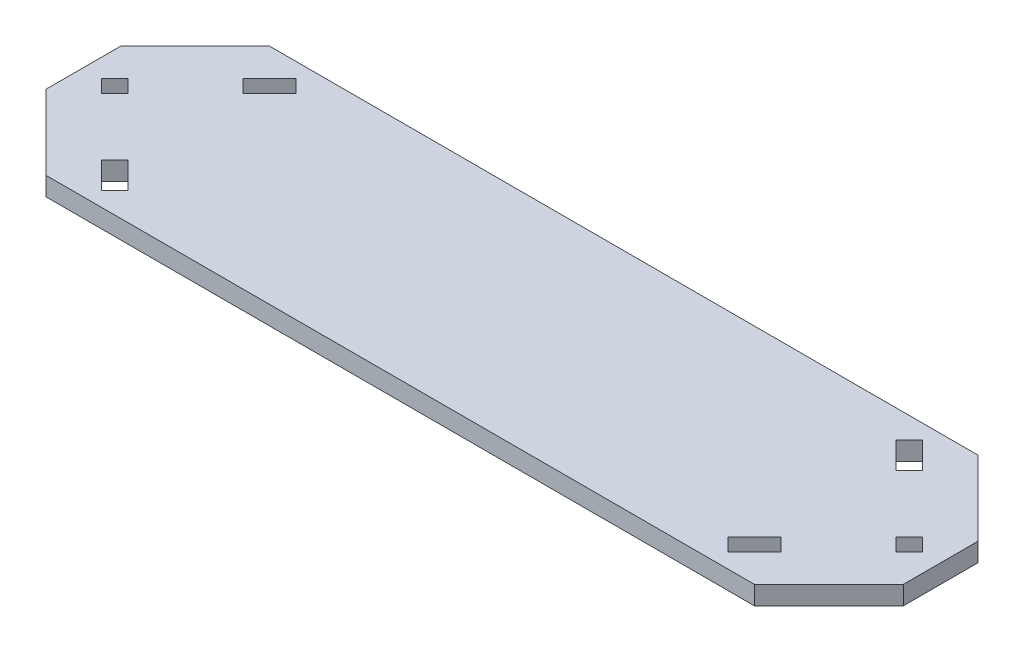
from build123d import *

# Parameters (mm, degrees)
SKETCH1_W           = 292.1
SKETCH1_H           = 76.2
BOSS_EXTRUDE1_DEPTH = 6.35
CHAMFER1_SIZE       = 25.4
CUT_EXTRUDE2_DEPTH  = 152.071291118


with BuildPart() as part:
    # Sketch1 → Boss-Extrude1 (new body)
    with BuildSketch(Plane(origin=(0, 0, 0), x_dir=(1, 0, 0), z_dir=(0, 1, 0))):
        Rectangle(SKETCH1_W, SKETCH1_H)
    extrude(amount=BOSS_EXTRUDE1_DEPTH)

    # Chamfer1
    chamfer1_edges = [part.edges().sort_by_distance(p)[0] for p in [
        (146.05, 3.175, -38.1),
        (146.05, 3.175, 38.1),
        (-146.05, 3.175, 38.1),
        (-146.05, 3.175, -38.1),
    ]]
    chamfer(chamfer1_edges, length=CHAMFER1_SIZE)

    # Sketch3 → Cut-Extrude2 (cut, through all)
    with BuildSketch(Plane(origin=(0, 6.35, 0), x_dir=(1, 0, 0), z_dir=(0, 1, 0))):
        Polygon((-130.81, 0), (-135.300128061, -4.490128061), (-139.790256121, 0), (-135.300128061, 4.490128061), align=None)
        Polygon((-102.235, -28.575), (-106.725128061, -33.065128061), (-115.705384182, -24.084871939), (-111.215256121, -19.594743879), align=None)
        Polygon((-102.235, 28.575), (-106.725128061, 33.065128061), (-115.705384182, 24.084871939), (-111.215256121, 19.594743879), align=None)
    cut_extrude2 = extrude(amount=-CUT_EXTRUDE2_DEPTH, mode=Mode.SUBTRACT)

    # Mirror1: Cut-Extrude2 across plane
    add(cut_extrude2.mirror(Plane(origin=(0, 0, 0), x_dir=(0, 0, 1), z_dir=(1, 0, 0))), mode=Mode.SUBTRACT)


solid = part.part
